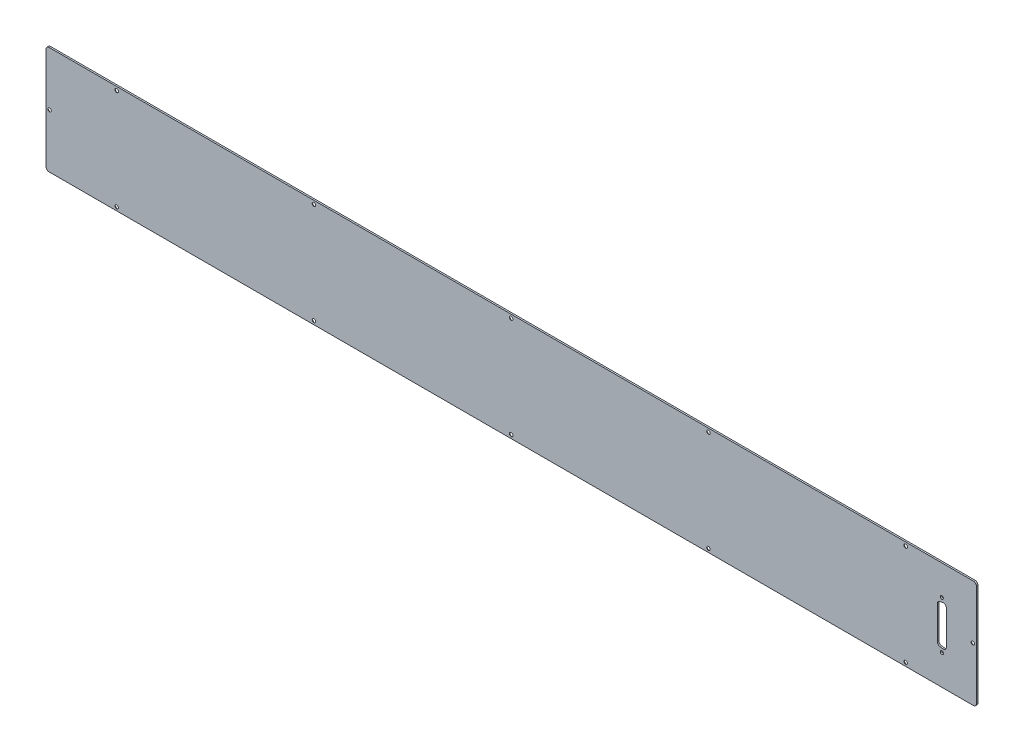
ISO-10303-21;
HEADER;
FILE_DESCRIPTION(('STEP AP214'),'2;1');
FILE_NAME('part.step','',(''),(''),'','','');
FILE_SCHEMA(('AUTOMOTIVE_DESIGN { 1 0 10303 214 1 1 1 1 }'));
ENDSEC;
DATA;
#1=APPLICATION_CONTEXT('core data for automotive mechanical design processes');
#2=APPLICATION_PROTOCOL_DEFINITION('international standard','automotive_design',2000,#1);
#3=PRODUCT_CONTEXT('',#1,'mechanical');
#4=PRODUCT('Part','Part','',(#3));
#5=PRODUCT_RELATED_PRODUCT_CATEGORY('part','',(#4));
#6=PRODUCT_DEFINITION_FORMATION('','',#4);
#7=PRODUCT_DEFINITION_CONTEXT('part definition',#1,'design');
#8=PRODUCT_DEFINITION('design','',#6,#7);
#9=PRODUCT_DEFINITION_SHAPE('','',#8);
#10=(LENGTH_UNIT() NAMED_UNIT(*) SI_UNIT(.MILLI.,.METRE.));
#11=(NAMED_UNIT(*) PLANE_ANGLE_UNIT() SI_UNIT($,.RADIAN.));
#12=(NAMED_UNIT(*) SI_UNIT($,.STERADIAN.) SOLID_ANGLE_UNIT());
#13=UNCERTAINTY_MEASURE_WITH_UNIT(LENGTH_MEASURE(1.E-05),#10,'distance_accuracy_value','');
#14=(GEOMETRIC_REPRESENTATION_CONTEXT(3) GLOBAL_UNCERTAINTY_ASSIGNED_CONTEXT((#13)) GLOBAL_UNIT_ASSIGNED_CONTEXT((#10,
#11,#12)) REPRESENTATION_CONTEXT('',''));
#15=CARTESIAN_POINT('',(0.,0.,0.));
#16=DIRECTION('',(0.,0.,1.));
#17=DIRECTION('',(1.,0.,0.));
#18=AXIS2_PLACEMENT_3D('',#15,#16,#17);
#19=CARTESIAN_POINT('',(457.5,-53.,1.5748));
#20=DIRECTION('',(-1.,0.,0.));
#21=DIRECTION('',(0.,0.,1.));
#22=AXIS2_PLACEMENT_3D('',#19,#20,#21);
#23=PLANE('',#22);
#24=DIRECTION('',(0.,1.,0.));
#25=VECTOR('',#24,1.);
#26=CARTESIAN_POINT('',(457.5,-53.,1.5748));
#27=LINE('',#26,#25);
#28=CARTESIAN_POINT('',(457.5,-50.,1.5748));
#29=VERTEX_POINT('',#28);
#30=CARTESIAN_POINT('',(457.5,50.,1.5748));
#31=VERTEX_POINT('',#30);
#32=EDGE_CURVE('E334',#29,#31,#27,.T.);
#33=ORIENTED_EDGE('',*,*,#32,.F.);
#34=DIRECTION('',(0.,0.,-1.));
#35=VECTOR('',#34,1.);
#36=CARTESIAN_POINT('',(457.5,-50.,1.5748));
#37=LINE('',#36,#35);
#38=CARTESIAN_POINT('',(457.5,-50.,0.));
#39=VERTEX_POINT('',#38);
#40=EDGE_CURVE('E11',#29,#39,#37,.T.);
#41=ORIENTED_EDGE('',*,*,#40,.T.);
#42=DIRECTION('',(0.,1.,0.));
#43=VECTOR('',#42,1.);
#44=CARTESIAN_POINT('',(457.5,-53.,0.));
#45=LINE('',#44,#43);
#46=CARTESIAN_POINT('',(457.5,50.,0.));
#47=VERTEX_POINT('',#46);
#48=EDGE_CURVE('E333',#39,#47,#45,.T.);
#49=ORIENTED_EDGE('',*,*,#48,.T.);
#50=DIRECTION('',(0.,0.,-1.));
#51=VECTOR('',#50,1.);
#52=CARTESIAN_POINT('',(457.5,50.,1.5748));
#53=LINE('',#52,#51);
#54=EDGE_CURVE('E42',#47,#31,#53,.F.);
#55=ORIENTED_EDGE('',*,*,#54,.T.);
#56=EDGE_LOOP('',(#33,#41,#49,#55));
#57=FACE_BOUND('',#56,.T.);
#58=ADVANCED_FACE('F34',(#57),#23,.F.);
#59=CARTESIAN_POINT('',(-457.5,53.,1.5748));
#60=DIRECTION('',(0.,-1.,0.));
#61=DIRECTION('',(0.,0.,-1.));
#62=AXIS2_PLACEMENT_3D('',#59,#60,#61);
#63=PLANE('',#62);
#64=DIRECTION('',(-1.,0.,0.));
#65=VECTOR('',#64,1.);
#66=CARTESIAN_POINT('',(-457.5,53.,0.));
#67=LINE('',#66,#65);
#68=CARTESIAN_POINT('',(454.5,53.,0.));
#69=VERTEX_POINT('',#68);
#70=CARTESIAN_POINT('',(-454.5,53.,0.));
#71=VERTEX_POINT('',#70);
#72=EDGE_CURVE('E350',#69,#71,#67,.T.);
#73=ORIENTED_EDGE('',*,*,#72,.T.);
#74=DIRECTION('',(0.,0.,-1.));
#75=VECTOR('',#74,1.);
#76=CARTESIAN_POINT('',(-454.5,53.,1.5748));
#77=LINE('',#76,#75);
#78=CARTESIAN_POINT('',(-454.5,53.,1.5748));
#79=VERTEX_POINT('',#78);
#80=EDGE_CURVE('E386',#71,#79,#77,.F.);
#81=ORIENTED_EDGE('',*,*,#80,.T.);
#82=DIRECTION('',(-1.,0.,0.));
#83=VECTOR('',#82,1.);
#84=CARTESIAN_POINT('',(-457.5,53.,1.5748));
#85=LINE('',#84,#83);
#86=CARTESIAN_POINT('',(454.5,53.,1.5748));
#87=VERTEX_POINT('',#86);
#88=EDGE_CURVE('E337',#87,#79,#85,.T.);
#89=ORIENTED_EDGE('',*,*,#88,.F.);
#90=DIRECTION('',(0.,0.,-1.));
#91=VECTOR('',#90,1.);
#92=CARTESIAN_POINT('',(454.5,53.,1.5748));
#93=LINE('',#92,#91);
#94=EDGE_CURVE('E383',#87,#69,#93,.T.);
#95=ORIENTED_EDGE('',*,*,#94,.T.);
#96=EDGE_LOOP('',(#73,#81,#89,#95));
#97=FACE_BOUND('',#96,.T.);
#98=ADVANCED_FACE('F400',(#97),#63,.F.);
#99=CARTESIAN_POINT('',(-457.5,-53.,1.5748));
#100=DIRECTION('',(1.,0.,0.));
#101=DIRECTION('',(0.,0.,-1.));
#102=AXIS2_PLACEMENT_3D('',#99,#100,#101);
#103=PLANE('',#102);
#104=DIRECTION('',(0.,-1.,0.));
#105=VECTOR('',#104,1.);
#106=CARTESIAN_POINT('',(-457.5,-53.,0.));
#107=LINE('',#106,#105);
#108=CARTESIAN_POINT('',(-457.5,50.,0.));
#109=VERTEX_POINT('',#108);
#110=CARTESIAN_POINT('',(-457.5,-50.,0.));
#111=VERTEX_POINT('',#110);
#112=EDGE_CURVE('E353',#109,#111,#107,.T.);
#113=ORIENTED_EDGE('',*,*,#112,.T.);
#114=DIRECTION('',(0.,0.,-1.));
#115=VECTOR('',#114,1.);
#116=CARTESIAN_POINT('',(-457.5,-50.,1.5748));
#117=LINE('',#116,#115);
#118=CARTESIAN_POINT('',(-457.5,-50.,1.5748));
#119=VERTEX_POINT('',#118);
#120=EDGE_CURVE('E373',#111,#119,#117,.F.);
#121=ORIENTED_EDGE('',*,*,#120,.T.);
#122=DIRECTION('',(0.,-1.,0.));
#123=VECTOR('',#122,1.);
#124=CARTESIAN_POINT('',(-457.5,-53.,1.5748));
#125=LINE('',#124,#123);
#126=CARTESIAN_POINT('',(-457.5,50.,1.5748));
#127=VERTEX_POINT('',#126);
#128=EDGE_CURVE('E341',#127,#119,#125,.T.);
#129=ORIENTED_EDGE('',*,*,#128,.F.);
#130=DIRECTION('',(0.,0.,-1.));
#131=VECTOR('',#130,1.);
#132=CARTESIAN_POINT('',(-457.5,50.,1.5748));
#133=LINE('',#132,#131);
#134=EDGE_CURVE('E370',#127,#109,#133,.T.);
#135=ORIENTED_EDGE('',*,*,#134,.T.);
#136=EDGE_LOOP('',(#113,#121,#129,#135));
#137=FACE_BOUND('',#136,.T.);
#138=ADVANCED_FACE('F412',(#137),#103,.F.);
#139=CARTESIAN_POINT('',(-457.5,-53.,1.5748));
#140=DIRECTION('',(0.,1.,0.));
#141=DIRECTION('',(0.,0.,1.));
#142=AXIS2_PLACEMENT_3D('',#139,#140,#141);
#143=PLANE('',#142);
#144=DIRECTION('',(1.,0.,0.));
#145=VECTOR('',#144,1.);
#146=CARTESIAN_POINT('',(-457.5,-53.,1.5748));
#147=LINE('',#146,#145);
#148=CARTESIAN_POINT('',(-454.5,-53.,1.5748));
#149=VERTEX_POINT('',#148);
#150=CARTESIAN_POINT('',(454.5,-53.,1.5748));
#151=VERTEX_POINT('',#150);
#152=EDGE_CURVE('E344',#149,#151,#147,.T.);
#153=ORIENTED_EDGE('',*,*,#152,.F.);
#154=DIRECTION('',(0.,0.,-1.));
#155=VECTOR('',#154,1.);
#156=CARTESIAN_POINT('',(-454.5,-53.,1.5748));
#157=LINE('',#156,#155);
#158=CARTESIAN_POINT('',(-454.5,-53.,0.));
#159=VERTEX_POINT('',#158);
#160=EDGE_CURVE('E359',#149,#159,#157,.T.);
#161=ORIENTED_EDGE('',*,*,#160,.T.);
#162=DIRECTION('',(1.,0.,0.));
#163=VECTOR('',#162,1.);
#164=CARTESIAN_POINT('',(-457.5,-53.,0.));
#165=LINE('',#164,#163);
#166=CARTESIAN_POINT('',(454.5,-53.,0.));
#167=VERTEX_POINT('',#166);
#168=EDGE_CURVE('E338',#159,#167,#165,.T.);
#169=ORIENTED_EDGE('',*,*,#168,.T.);
#170=DIRECTION('',(0.,0.,-1.));
#171=VECTOR('',#170,1.);
#172=CARTESIAN_POINT('',(454.5,-53.,1.5748));
#173=LINE('',#172,#171);
#174=EDGE_CURVE('E347',#167,#151,#173,.F.);
#175=ORIENTED_EDGE('',*,*,#174,.T.);
#176=EDGE_LOOP('',(#153,#161,#169,#175));
#177=FACE_BOUND('',#176,.T.);
#178=ADVANCED_FACE('F420',(#177),#143,.F.);
#179=CARTESIAN_POINT('',(0.,0.,1.5748));
#180=DIRECTION('',(0.,0.,-1.));
#181=DIRECTION('',(-1.,0.,0.));
#182=AXIS2_PLACEMENT_3D('',#179,#180,#181);
#183=PLANE('',#182);
#184=CARTESIAN_POINT('',(423.5,-23.5,1.5748));
#185=DIRECTION('',(0.,0.,-1.));
#186=DIRECTION('',(1.,0.,0.));
#187=AXIS2_PLACEMENT_3D('',#184,#185,#186);
#188=CIRCLE('',#187,1.54999999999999);
#189=CARTESIAN_POINT('',(425.05,-23.5,1.5748));
#190=VERTEX_POINT('',#189);
#191=EDGE_CURVE('E190',#190,#190,#188,.T.);
#192=ORIENTED_EDGE('',*,*,#191,.T.);
#193=EDGE_LOOP('',(#192));
#194=FACE_BOUND('',#193,.T.);
#195=DIRECTION('',(0.,1.,0.));
#196=VECTOR('',#195,1.);
#197=CARTESIAN_POINT('',(419.05,16.22665,1.5748));
#198=LINE('',#197,#196);
#199=CARTESIAN_POINT('',(419.05,-16.22665,1.5748));
#200=VERTEX_POINT('',#199);
#201=CARTESIAN_POINT('',(419.05,16.22665,1.5748));
#202=VERTEX_POINT('',#201);
#203=EDGE_CURVE('E155',#200,#202,#198,.T.);
#204=ORIENTED_EDGE('',*,*,#203,.T.);
#205=CARTESIAN_POINT('',(422.05,16.22665,1.5748));
#206=DIRECTION('',(0.,0.,-1.));
#207=DIRECTION('',(1.,0.,0.));
#208=AXIS2_PLACEMENT_3D('',#205,#206,#207);
#209=CIRCLE('',#208,3.00000000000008);
#210=CARTESIAN_POINT('',(421.529053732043,19.1810729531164,1.5748));
#211=VERTEX_POINT('',#210);
#212=EDGE_CURVE('E149',#202,#211,#209,.T.);
#213=ORIENTED_EDGE('',*,*,#212,.T.);
#214=DIRECTION('',(0.984807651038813,0.173648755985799,0.));
#215=VECTOR('',#214,1.);
#216=CARTESIAN_POINT('',(424.429053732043,19.6924229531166,1.5748));
#217=LINE('',#216,#215);
#218=CARTESIAN_POINT('',(424.429053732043,19.6924229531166,1.5748));
#219=VERTEX_POINT('',#218);
#220=EDGE_CURVE('E158',#211,#219,#217,.T.);
#221=ORIENTED_EDGE('',*,*,#220,.T.);
#222=CARTESIAN_POINT('',(424.95,16.7380000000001,1.5748));
#223=DIRECTION('',(0.,0.,-1.));
#224=DIRECTION('',(1.,0.,0.));
#225=AXIS2_PLACEMENT_3D('',#222,#223,#224);
#226=CIRCLE('',#225,2.99999999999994);
#227=CARTESIAN_POINT('',(427.95,16.7380000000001,1.5748));
#228=VERTEX_POINT('',#227);
#229=EDGE_CURVE('E49',#219,#228,#226,.T.);
#230=ORIENTED_EDGE('',*,*,#229,.T.);
#231=DIRECTION('',(0.,-1.,0.));
#232=VECTOR('',#231,1.);
#233=CARTESIAN_POINT('',(427.95,-16.7380000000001,1.5748));
#234=LINE('',#233,#232);
#235=CARTESIAN_POINT('',(427.95,-16.7380000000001,1.5748));
#236=VERTEX_POINT('',#235);
#237=EDGE_CURVE('E176',#228,#236,#234,.T.);
#238=ORIENTED_EDGE('',*,*,#237,.T.);
#239=CARTESIAN_POINT('',(424.95,-16.7380000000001,1.5748));
#240=DIRECTION('',(0.,0.,-1.));
#241=DIRECTION('',(-1.,0.,0.));
#242=AXIS2_PLACEMENT_3D('',#239,#240,#241);
#243=CIRCLE('',#242,2.99999999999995);
#244=CARTESIAN_POINT('',(424.429053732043,-19.6924229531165,1.5748));
#245=VERTEX_POINT('',#244);
#246=EDGE_CURVE('E179',#236,#245,#243,.T.);
#247=ORIENTED_EDGE('',*,*,#246,.T.);
#248=DIRECTION('',(-0.984807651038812,0.173648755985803,0.));
#249=VECTOR('',#248,1.);
#250=CARTESIAN_POINT('',(424.429053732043,-19.6924229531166,1.5748));
#251=LINE('',#250,#249);
#252=CARTESIAN_POINT('',(421.529053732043,-19.1810729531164,1.5748));
#253=VERTEX_POINT('',#252);
#254=EDGE_CURVE('E182',#245,#253,#251,.T.);
#255=ORIENTED_EDGE('',*,*,#254,.T.);
#256=CARTESIAN_POINT('',(422.05,-16.22665,1.5748));
#257=DIRECTION('',(0.,0.,-1.));
#258=DIRECTION('',(-1.,0.,0.));
#259=AXIS2_PLACEMENT_3D('',#256,#257,#258);
#260=CIRCLE('',#259,3.00000000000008);
#261=EDGE_CURVE('E185',#253,#200,#260,.T.);
#262=ORIENTED_EDGE('',*,*,#261,.T.);
#263=EDGE_LOOP('',(#204,#213,#221,#230,#238,#247,#255,#262));
#264=FACE_BOUND('',#263,.T.);
#265=CARTESIAN_POINT('',(423.5,23.5,1.5748));
#266=DIRECTION('',(0.,0.,-1.));
#267=DIRECTION('',(-1.,0.,0.));
#268=AXIS2_PLACEMENT_3D('',#265,#266,#267);
#269=CIRCLE('',#268,1.54999999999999);
#270=CARTESIAN_POINT('',(421.95,23.5,1.5748));
#271=VERTEX_POINT('',#270);
#272=EDGE_CURVE('E220',#271,#271,#269,.T.);
#273=ORIENTED_EDGE('',*,*,#272,.T.);
#274=EDGE_LOOP('',(#273));
#275=FACE_BOUND('',#274,.T.);
#276=CARTESIAN_POINT('',(-388.,49.5,1.5748));
#277=DIRECTION('',(0.,0.,-1.));
#278=DIRECTION('',(-1.,0.,0.));
#279=AXIS2_PLACEMENT_3D('',#276,#277,#278);
#280=CIRCLE('',#279,1.69999999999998);
#281=CARTESIAN_POINT('',(-389.7,49.5,1.5748));
#282=VERTEX_POINT('',#281);
#283=EDGE_CURVE('E231',#282,#282,#280,.T.);
#284=ORIENTED_EDGE('',*,*,#283,.T.);
#285=EDGE_LOOP('',(#284));
#286=FACE_BOUND('',#285,.T.);
#287=CARTESIAN_POINT('',(-194.,49.5,1.5748));
#288=DIRECTION('',(0.,0.,-1.));
#289=DIRECTION('',(-1.,0.,0.));
#290=AXIS2_PLACEMENT_3D('',#287,#288,#289);
#291=CIRCLE('',#290,1.70000000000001);
#292=CARTESIAN_POINT('',(-195.7,49.5,1.5748));
#293=VERTEX_POINT('',#292);
#294=EDGE_CURVE('E240',#293,#293,#291,.T.);
#295=ORIENTED_EDGE('',*,*,#294,.T.);
#296=EDGE_LOOP('',(#295));
#297=FACE_BOUND('',#296,.T.);
#298=CARTESIAN_POINT('',(0.,49.5,1.5748));
#299=DIRECTION('',(0.,0.,-1.));
#300=DIRECTION('',(-1.,0.,0.));
#301=AXIS2_PLACEMENT_3D('',#298,#299,#300);
#302=CIRCLE('',#301,1.7);
#303=CARTESIAN_POINT('',(-1.7,49.5,1.5748));
#304=VERTEX_POINT('',#303);
#305=EDGE_CURVE('E249',#304,#304,#302,.T.);
#306=ORIENTED_EDGE('',*,*,#305,.T.);
#307=EDGE_LOOP('',(#306));
#308=FACE_BOUND('',#307,.T.);
#309=CARTESIAN_POINT('',(-194.,-49.5000000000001,1.5748));
#310=DIRECTION('',(0.,0.,-1.));
#311=DIRECTION('',(-1.,0.,0.));
#312=AXIS2_PLACEMENT_3D('',#309,#310,#311);
#313=CIRCLE('',#312,1.70000000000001);
#314=CARTESIAN_POINT('',(-195.7,-49.5000000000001,1.5748));
#315=VERTEX_POINT('',#314);
#316=EDGE_CURVE('E258',#315,#315,#313,.T.);
#317=ORIENTED_EDGE('',*,*,#316,.T.);
#318=EDGE_LOOP('',(#317));
#319=FACE_BOUND('',#318,.T.);
#320=CARTESIAN_POINT('',(-388.,-49.5000000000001,1.5748));
#321=DIRECTION('',(0.,0.,-1.));
#322=DIRECTION('',(-1.,0.,0.));
#323=AXIS2_PLACEMENT_3D('',#320,#321,#322);
#324=CIRCLE('',#323,1.69999999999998);
#325=CARTESIAN_POINT('',(-389.7,-49.5000000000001,1.5748));
#326=VERTEX_POINT('',#325);
#327=EDGE_CURVE('E267',#326,#326,#324,.T.);
#328=ORIENTED_EDGE('',*,*,#327,.T.);
#329=EDGE_LOOP('',(#328));
#330=FACE_BOUND('',#329,.T.);
#331=CARTESIAN_POINT('',(0.,-49.5,1.5748));
#332=DIRECTION('',(0.,0.,-1.));
#333=DIRECTION('',(-1.,0.,0.));
#334=AXIS2_PLACEMENT_3D('',#331,#332,#333);
#335=CIRCLE('',#334,1.7);
#336=CARTESIAN_POINT('',(-1.7,-49.5,1.5748));
#337=VERTEX_POINT('',#336);
#338=EDGE_CURVE('E276',#337,#337,#335,.T.);
#339=ORIENTED_EDGE('',*,*,#338,.T.);
#340=EDGE_LOOP('',(#339));
#341=FACE_BOUND('',#340,.T.);
#342=CARTESIAN_POINT('',(388.,-49.5000000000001,1.5748));
#343=DIRECTION('',(0.,0.,-1.));
#344=DIRECTION('',(-1.,0.,0.));
#345=AXIS2_PLACEMENT_3D('',#342,#343,#344);
#346=CIRCLE('',#345,1.69999999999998);
#347=CARTESIAN_POINT('',(386.3,-49.5000000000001,1.5748));
#348=VERTEX_POINT('',#347);
#349=EDGE_CURVE('E285',#348,#348,#346,.T.);
#350=ORIENTED_EDGE('',*,*,#349,.T.);
#351=EDGE_LOOP('',(#350));
#352=FACE_BOUND('',#351,.T.);
#353=CARTESIAN_POINT('',(388.,49.5000000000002,1.5748));
#354=DIRECTION('',(0.,0.,-1.));
#355=DIRECTION('',(-1.,0.,0.));
#356=AXIS2_PLACEMENT_3D('',#353,#354,#355);
#357=CIRCLE('',#356,1.69999999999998);
#358=CARTESIAN_POINT('',(386.3,49.5000000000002,1.5748));
#359=VERTEX_POINT('',#358);
#360=EDGE_CURVE('E294',#359,#359,#357,.T.);
#361=ORIENTED_EDGE('',*,*,#360,.T.);
#362=EDGE_LOOP('',(#361));
#363=FACE_BOUND('',#362,.T.);
#364=CARTESIAN_POINT('',(194.,49.5000000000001,1.5748));
#365=DIRECTION('',(0.,0.,-1.));
#366=DIRECTION('',(-1.,0.,0.));
#367=AXIS2_PLACEMENT_3D('',#364,#365,#366);
#368=CIRCLE('',#367,1.70000000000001);
#369=CARTESIAN_POINT('',(192.3,49.5000000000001,1.5748));
#370=VERTEX_POINT('',#369);
#371=EDGE_CURVE('E303',#370,#370,#368,.T.);
#372=ORIENTED_EDGE('',*,*,#371,.T.);
#373=EDGE_LOOP('',(#372));
#374=FACE_BOUND('',#373,.T.);
#375=CARTESIAN_POINT('',(194.,-49.5000000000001,1.5748));
#376=DIRECTION('',(0.,0.,-1.));
#377=DIRECTION('',(-1.,0.,0.));
#378=AXIS2_PLACEMENT_3D('',#375,#376,#377);
#379=CIRCLE('',#378,1.70000000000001);
#380=CARTESIAN_POINT('',(192.3,-49.5000000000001,1.5748));
#381=VERTEX_POINT('',#380);
#382=EDGE_CURVE('E312',#381,#381,#379,.T.);
#383=ORIENTED_EDGE('',*,*,#382,.T.);
#384=EDGE_LOOP('',(#383));
#385=FACE_BOUND('',#384,.T.);
#386=CARTESIAN_POINT('',(-454.,0.,1.5748));
#387=DIRECTION('',(0.,0.,-1.));
#388=DIRECTION('',(-1.,0.,0.));
#389=AXIS2_PLACEMENT_3D('',#386,#387,#388);
#390=CIRCLE('',#389,1.69999999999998);
#391=CARTESIAN_POINT('',(-455.7,0.,1.5748));
#392=VERTEX_POINT('',#391);
#393=EDGE_CURVE('E321',#392,#392,#390,.T.);
#394=ORIENTED_EDGE('',*,*,#393,.T.);
#395=EDGE_LOOP('',(#394));
#396=FACE_BOUND('',#395,.T.);
#397=CARTESIAN_POINT('',(454.,0.,1.5748));
#398=DIRECTION('',(0.,0.,-1.));
#399=DIRECTION('',(-1.,0.,0.));
#400=AXIS2_PLACEMENT_3D('',#397,#398,#399);
#401=CIRCLE('',#400,1.69999999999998);
#402=CARTESIAN_POINT('',(452.3,0.,1.5748));
#403=VERTEX_POINT('',#402);
#404=EDGE_CURVE('E330',#403,#403,#401,.T.);
#405=ORIENTED_EDGE('',*,*,#404,.T.);
#406=EDGE_LOOP('',(#405));
#407=FACE_BOUND('',#406,.T.);
#408=ORIENTED_EDGE('',*,*,#128,.T.);
#409=CARTESIAN_POINT('',(-454.5,-50.,1.5748));
#410=DIRECTION('',(0.,0.,-1.));
#411=DIRECTION('',(-1.,0.,0.));
#412=AXIS2_PLACEMENT_3D('',#409,#410,#411);
#413=CIRCLE('',#412,3.);
#414=EDGE_CURVE('E381',#119,#149,#413,.F.);
#415=ORIENTED_EDGE('',*,*,#414,.T.);
#416=ORIENTED_EDGE('',*,*,#152,.T.);
#417=CARTESIAN_POINT('',(454.5,-50.,1.5748));
#418=DIRECTION('',(0.,0.,-1.));
#419=DIRECTION('',(-1.,0.,0.));
#420=AXIS2_PLACEMENT_3D('',#417,#418,#419);
#421=CIRCLE('',#420,3.);
#422=EDGE_CURVE('E377',#151,#29,#421,.F.);
#423=ORIENTED_EDGE('',*,*,#422,.T.);
#424=ORIENTED_EDGE('',*,*,#32,.T.);
#425=CARTESIAN_POINT('',(454.5,50.,1.5748));
#426=DIRECTION('',(0.,0.,-1.));
#427=DIRECTION('',(-1.,0.,0.));
#428=AXIS2_PLACEMENT_3D('',#425,#426,#427);
#429=CIRCLE('',#428,3.);
#430=EDGE_CURVE('E375',#31,#87,#429,.F.);
#431=ORIENTED_EDGE('',*,*,#430,.T.);
#432=ORIENTED_EDGE('',*,*,#88,.T.);
#433=CARTESIAN_POINT('',(-454.5,50.,1.5748));
#434=DIRECTION('',(0.,0.,-1.));
#435=DIRECTION('',(-1.,0.,0.));
#436=AXIS2_PLACEMENT_3D('',#433,#434,#435);
#437=CIRCLE('',#436,3.);
#438=EDGE_CURVE('E379',#79,#127,#437,.F.);
#439=ORIENTED_EDGE('',*,*,#438,.T.);
#440=EDGE_LOOP('',(#408,#415,#416,#423,#424,#431,#432,#439));
#441=FACE_BOUND('',#440,.T.);
#442=ADVANCED_FACE('F162',(#194,#264,#275,#286,#297,#308,#319,#330,#341,#352,#363,#374,#385,
#396,#407,#441),#183,.F.);
#443=CARTESIAN_POINT('',(0.,0.,0.));
#444=DIRECTION('',(0.,0.,-1.));
#445=DIRECTION('',(-1.,0.,0.));
#446=AXIS2_PLACEMENT_3D('',#443,#444,#445);
#447=PLANE('',#446);
#448=CARTESIAN_POINT('',(423.5,-23.5,0.));
#449=DIRECTION('',(0.,0.,-1.));
#450=DIRECTION('',(1.,0.,0.));
#451=AXIS2_PLACEMENT_3D('',#448,#449,#450);
#452=CIRCLE('',#451,1.54999999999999);
#453=CARTESIAN_POINT('',(425.05,-23.5,0.));
#454=VERTEX_POINT('',#453);
#455=EDGE_CURVE('E172',#454,#454,#452,.T.);
#456=ORIENTED_EDGE('',*,*,#455,.F.);
#457=EDGE_LOOP('',(#456));
#458=FACE_BOUND('',#457,.T.);
#459=CARTESIAN_POINT('',(422.05,16.22665,0.));
#460=DIRECTION('',(0.,0.,-1.));
#461=DIRECTION('',(1.,0.,0.));
#462=AXIS2_PLACEMENT_3D('',#459,#460,#461);
#463=CIRCLE('',#462,3.00000000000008);
#464=CARTESIAN_POINT('',(419.05,16.22665,0.));
#465=VERTEX_POINT('',#464);
#466=CARTESIAN_POINT('',(421.529053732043,19.1810729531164,0.));
#467=VERTEX_POINT('',#466);
#468=EDGE_CURVE('E57',#465,#467,#463,.T.);
#469=ORIENTED_EDGE('',*,*,#468,.F.);
#470=DIRECTION('',(0.,1.,0.));
#471=VECTOR('',#470,1.);
#472=CARTESIAN_POINT('',(419.05,16.22665,0.));
#473=LINE('',#472,#471);
#474=CARTESIAN_POINT('',(419.05,-16.22665,0.));
#475=VERTEX_POINT('',#474);
#476=EDGE_CURVE('E166',#475,#465,#473,.T.);
#477=ORIENTED_EDGE('',*,*,#476,.F.);
#478=CARTESIAN_POINT('',(422.05,-16.22665,0.));
#479=DIRECTION('',(0.,0.,-1.));
#480=DIRECTION('',(-1.,0.,0.));
#481=AXIS2_PLACEMENT_3D('',#478,#479,#480);
#482=CIRCLE('',#481,3.00000000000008);
#483=CARTESIAN_POINT('',(421.529053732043,-19.1810729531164,0.));
#484=VERTEX_POINT('',#483);
#485=EDGE_CURVE('E169',#484,#475,#482,.T.);
#486=ORIENTED_EDGE('',*,*,#485,.F.);
#487=DIRECTION('',(-0.984807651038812,0.173648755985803,0.));
#488=VECTOR('',#487,1.);
#489=CARTESIAN_POINT('',(424.429053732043,-19.6924229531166,0.));
#490=LINE('',#489,#488);
#491=CARTESIAN_POINT('',(424.429053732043,-19.6924229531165,0.));
#492=VERTEX_POINT('',#491);
#493=EDGE_CURVE('E201',#492,#484,#490,.T.);
#494=ORIENTED_EDGE('',*,*,#493,.F.);
#495=CARTESIAN_POINT('',(424.95,-16.7380000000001,0.));
#496=DIRECTION('',(0.,0.,-1.));
#497=DIRECTION('',(-1.,0.,0.));
#498=AXIS2_PLACEMENT_3D('',#495,#496,#497);
#499=CIRCLE('',#498,2.99999999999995);
#500=CARTESIAN_POINT('',(427.95,-16.7380000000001,0.));
#501=VERTEX_POINT('',#500);
#502=EDGE_CURVE('E198',#501,#492,#499,.T.);
#503=ORIENTED_EDGE('',*,*,#502,.F.);
#504=DIRECTION('',(0.,-1.,0.));
#505=VECTOR('',#504,1.);
#506=CARTESIAN_POINT('',(427.95,-16.7380000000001,0.));
#507=LINE('',#506,#505);
#508=CARTESIAN_POINT('',(427.95,16.7380000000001,0.));
#509=VERTEX_POINT('',#508);
#510=EDGE_CURVE('E195',#509,#501,#507,.T.);
#511=ORIENTED_EDGE('',*,*,#510,.F.);
#512=CARTESIAN_POINT('',(424.95,16.7380000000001,0.));
#513=DIRECTION('',(0.,0.,-1.));
#514=DIRECTION('',(1.,0.,0.));
#515=AXIS2_PLACEMENT_3D('',#512,#513,#514);
#516=CIRCLE('',#515,2.99999999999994);
#517=CARTESIAN_POINT('',(424.429053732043,19.6924229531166,0.));
#518=VERTEX_POINT('',#517);
#519=EDGE_CURVE('E192',#518,#509,#516,.T.);
#520=ORIENTED_EDGE('',*,*,#519,.F.);
#521=DIRECTION('',(0.984807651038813,0.173648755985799,0.));
#522=VECTOR('',#521,1.);
#523=CARTESIAN_POINT('',(424.429053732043,19.6924229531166,0.));
#524=LINE('',#523,#522);
#525=EDGE_CURVE('E189',#467,#518,#524,.T.);
#526=ORIENTED_EDGE('',*,*,#525,.F.);
#527=EDGE_LOOP('',(#469,#477,#486,#494,#503,#511,#520,#526));
#528=FACE_BOUND('',#527,.T.);
#529=CARTESIAN_POINT('',(423.5,23.5,0.));
#530=DIRECTION('',(0.,0.,-1.));
#531=DIRECTION('',(-1.,0.,0.));
#532=AXIS2_PLACEMENT_3D('',#529,#530,#531);
#533=CIRCLE('',#532,1.54999999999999);
#534=CARTESIAN_POINT('',(421.95,23.5,0.));
#535=VERTEX_POINT('',#534);
#536=EDGE_CURVE('E208',#535,#535,#533,.T.);
#537=ORIENTED_EDGE('',*,*,#536,.F.);
#538=EDGE_LOOP('',(#537));
#539=FACE_BOUND('',#538,.T.);
#540=CARTESIAN_POINT('',(-388.,49.5,0.));
#541=DIRECTION('',(0.,0.,-1.));
#542=DIRECTION('',(-1.,0.,0.));
#543=AXIS2_PLACEMENT_3D('',#540,#541,#542);
#544=CIRCLE('',#543,3.14999999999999);
#545=CARTESIAN_POINT('',(-391.15,49.5,0.));
#546=VERTEX_POINT('',#545);
#547=EDGE_CURVE('E223',#546,#546,#544,.T.);
#548=ORIENTED_EDGE('',*,*,#547,.F.);
#549=EDGE_LOOP('',(#548));
#550=FACE_BOUND('',#549,.T.);
#551=CARTESIAN_POINT('',(-194.,49.5,0.));
#552=DIRECTION('',(0.,0.,-1.));
#553=DIRECTION('',(-1.,0.,0.));
#554=AXIS2_PLACEMENT_3D('',#551,#552,#553);
#555=CIRCLE('',#554,3.14999999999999);
#556=CARTESIAN_POINT('',(-197.15,49.5,0.));
#557=VERTEX_POINT('',#556);
#558=EDGE_CURVE('E234',#557,#557,#555,.T.);
#559=ORIENTED_EDGE('',*,*,#558,.F.);
#560=EDGE_LOOP('',(#559));
#561=FACE_BOUND('',#560,.T.);
#562=CARTESIAN_POINT('',(0.,49.5,0.));
#563=DIRECTION('',(0.,0.,-1.));
#564=DIRECTION('',(-1.,0.,0.));
#565=AXIS2_PLACEMENT_3D('',#562,#563,#564);
#566=CIRCLE('',#565,3.15);
#567=CARTESIAN_POINT('',(-3.15,49.5,0.));
#568=VERTEX_POINT('',#567);
#569=EDGE_CURVE('E243',#568,#568,#566,.T.);
#570=ORIENTED_EDGE('',*,*,#569,.F.);
#571=EDGE_LOOP('',(#570));
#572=FACE_BOUND('',#571,.T.);
#573=CARTESIAN_POINT('',(-194.,-49.5000000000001,0.));
#574=DIRECTION('',(0.,0.,-1.));
#575=DIRECTION('',(-1.,0.,0.));
#576=AXIS2_PLACEMENT_3D('',#573,#574,#575);
#577=CIRCLE('',#576,3.14999999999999);
#578=CARTESIAN_POINT('',(-197.15,-49.5000000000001,0.));
#579=VERTEX_POINT('',#578);
#580=EDGE_CURVE('E252',#579,#579,#577,.T.);
#581=ORIENTED_EDGE('',*,*,#580,.F.);
#582=EDGE_LOOP('',(#581));
#583=FACE_BOUND('',#582,.T.);
#584=CARTESIAN_POINT('',(-388.,-49.5000000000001,0.));
#585=DIRECTION('',(0.,0.,-1.));
#586=DIRECTION('',(-1.,0.,0.));
#587=AXIS2_PLACEMENT_3D('',#584,#585,#586);
#588=CIRCLE('',#587,3.14999999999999);
#589=CARTESIAN_POINT('',(-391.15,-49.5000000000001,0.));
#590=VERTEX_POINT('',#589);
#591=EDGE_CURVE('E261',#590,#590,#588,.T.);
#592=ORIENTED_EDGE('',*,*,#591,.F.);
#593=EDGE_LOOP('',(#592));
#594=FACE_BOUND('',#593,.T.);
#595=CARTESIAN_POINT('',(0.,-49.5,0.));
#596=DIRECTION('',(0.,0.,-1.));
#597=DIRECTION('',(-1.,0.,0.));
#598=AXIS2_PLACEMENT_3D('',#595,#596,#597);
#599=CIRCLE('',#598,3.15);
#600=CARTESIAN_POINT('',(-3.15,-49.5,0.));
#601=VERTEX_POINT('',#600);
#602=EDGE_CURVE('E270',#601,#601,#599,.T.);
#603=ORIENTED_EDGE('',*,*,#602,.F.);
#604=EDGE_LOOP('',(#603));
#605=FACE_BOUND('',#604,.T.);
#606=CARTESIAN_POINT('',(388.,-49.5000000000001,0.));
#607=DIRECTION('',(0.,0.,-1.));
#608=DIRECTION('',(-1.,0.,0.));
#609=AXIS2_PLACEMENT_3D('',#606,#607,#608);
#610=CIRCLE('',#609,3.14999999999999);
#611=CARTESIAN_POINT('',(384.85,-49.5000000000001,0.));
#612=VERTEX_POINT('',#611);
#613=EDGE_CURVE('E279',#612,#612,#610,.T.);
#614=ORIENTED_EDGE('',*,*,#613,.F.);
#615=EDGE_LOOP('',(#614));
#616=FACE_BOUND('',#615,.T.);
#617=CARTESIAN_POINT('',(388.,49.5000000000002,0.));
#618=DIRECTION('',(0.,0.,-1.));
#619=DIRECTION('',(-1.,0.,0.));
#620=AXIS2_PLACEMENT_3D('',#617,#618,#619);
#621=CIRCLE('',#620,3.14999999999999);
#622=CARTESIAN_POINT('',(384.85,49.5000000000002,0.));
#623=VERTEX_POINT('',#622);
#624=EDGE_CURVE('E288',#623,#623,#621,.T.);
#625=ORIENTED_EDGE('',*,*,#624,.F.);
#626=EDGE_LOOP('',(#625));
#627=FACE_BOUND('',#626,.T.);
#628=CARTESIAN_POINT('',(194.,49.5000000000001,0.));
#629=DIRECTION('',(0.,0.,-1.));
#630=DIRECTION('',(-1.,0.,0.));
#631=AXIS2_PLACEMENT_3D('',#628,#629,#630);
#632=CIRCLE('',#631,3.14999999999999);
#633=CARTESIAN_POINT('',(190.85,49.5000000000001,0.));
#634=VERTEX_POINT('',#633);
#635=EDGE_CURVE('E297',#634,#634,#632,.T.);
#636=ORIENTED_EDGE('',*,*,#635,.F.);
#637=EDGE_LOOP('',(#636));
#638=FACE_BOUND('',#637,.T.);
#639=CARTESIAN_POINT('',(194.,-49.5000000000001,0.));
#640=DIRECTION('',(0.,0.,-1.));
#641=DIRECTION('',(-1.,0.,0.));
#642=AXIS2_PLACEMENT_3D('',#639,#640,#641);
#643=CIRCLE('',#642,3.14999999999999);
#644=CARTESIAN_POINT('',(190.85,-49.5000000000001,0.));
#645=VERTEX_POINT('',#644);
#646=EDGE_CURVE('E306',#645,#645,#643,.T.);
#647=ORIENTED_EDGE('',*,*,#646,.F.);
#648=EDGE_LOOP('',(#647));
#649=FACE_BOUND('',#648,.T.);
#650=CARTESIAN_POINT('',(-454.,0.,0.));
#651=DIRECTION('',(0.,0.,-1.));
#652=DIRECTION('',(-1.,0.,0.));
#653=AXIS2_PLACEMENT_3D('',#650,#651,#652);
#654=CIRCLE('',#653,3.14999999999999);
#655=CARTESIAN_POINT('',(-457.15,0.,0.));
#656=VERTEX_POINT('',#655);
#657=EDGE_CURVE('E315',#656,#656,#654,.T.);
#658=ORIENTED_EDGE('',*,*,#657,.F.);
#659=EDGE_LOOP('',(#658));
#660=FACE_BOUND('',#659,.T.);
#661=CARTESIAN_POINT('',(454.,0.,0.));
#662=DIRECTION('',(0.,0.,-1.));
#663=DIRECTION('',(-1.,0.,0.));
#664=AXIS2_PLACEMENT_3D('',#661,#662,#663);
#665=CIRCLE('',#664,3.14999999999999);
#666=CARTESIAN_POINT('',(450.85,0.,0.));
#667=VERTEX_POINT('',#666);
#668=EDGE_CURVE('E324',#667,#667,#665,.T.);
#669=ORIENTED_EDGE('',*,*,#668,.F.);
#670=EDGE_LOOP('',(#669));
#671=FACE_BOUND('',#670,.T.);
#672=ORIENTED_EDGE('',*,*,#168,.F.);
#673=CARTESIAN_POINT('',(-454.5,-50.,0.));
#674=DIRECTION('',(0.,0.,-1.));
#675=DIRECTION('',(-1.,0.,0.));
#676=AXIS2_PLACEMENT_3D('',#673,#674,#675);
#677=CIRCLE('',#676,3.);
#678=EDGE_CURVE('E368',#159,#111,#677,.T.);
#679=ORIENTED_EDGE('',*,*,#678,.T.);
#680=ORIENTED_EDGE('',*,*,#112,.F.);
#681=CARTESIAN_POINT('',(-454.5,50.,0.));
#682=DIRECTION('',(0.,0.,-1.));
#683=DIRECTION('',(-1.,0.,0.));
#684=AXIS2_PLACEMENT_3D('',#681,#682,#683);
#685=CIRCLE('',#684,3.);
#686=EDGE_CURVE('E366',#109,#71,#685,.T.);
#687=ORIENTED_EDGE('',*,*,#686,.T.);
#688=ORIENTED_EDGE('',*,*,#72,.F.);
#689=CARTESIAN_POINT('',(454.5,50.,0.));
#690=DIRECTION('',(0.,0.,-1.));
#691=DIRECTION('',(-1.,0.,0.));
#692=AXIS2_PLACEMENT_3D('',#689,#690,#691);
#693=CIRCLE('',#692,3.);
#694=EDGE_CURVE('E362',#69,#47,#693,.T.);
#695=ORIENTED_EDGE('',*,*,#694,.T.);
#696=ORIENTED_EDGE('',*,*,#48,.F.);
#697=CARTESIAN_POINT('',(454.5,-50.,0.));
#698=DIRECTION('',(0.,0.,-1.));
#699=DIRECTION('',(-1.,0.,0.));
#700=AXIS2_PLACEMENT_3D('',#697,#698,#699);
#701=CIRCLE('',#700,3.);
#702=EDGE_CURVE('E364',#39,#167,#701,.T.);
#703=ORIENTED_EDGE('',*,*,#702,.T.);
#704=EDGE_LOOP('',(#672,#679,#680,#687,#688,#695,#696,#703));
#705=FACE_BOUND('',#704,.T.);
#706=ADVANCED_FACE('F404',(#458,#528,#539,#550,#561,#572,#583,#594,#605,#616,#627,#638,#649,
#660,#671,#705),#447,.T.);
#707=CARTESIAN_POINT('',(-454.5,-50.,1.5748));
#708=DIRECTION('',(0.,0.,-1.));
#709=DIRECTION('',(-1.,0.,0.));
#710=AXIS2_PLACEMENT_3D('',#707,#708,#709);
#711=CYLINDRICAL_SURFACE('',#710,3.);
#712=ORIENTED_EDGE('',*,*,#414,.F.);
#713=ORIENTED_EDGE('',*,*,#120,.F.);
#714=ORIENTED_EDGE('',*,*,#678,.F.);
#715=ORIENTED_EDGE('',*,*,#160,.F.);
#716=EDGE_LOOP('',(#712,#713,#714,#715));
#717=FACE_BOUND('',#716,.T.);
#718=ADVANCED_FACE('F418',(#717),#711,.T.);
#719=CARTESIAN_POINT('',(-454.5,50.,1.5748));
#720=DIRECTION('',(0.,0.,-1.));
#721=DIRECTION('',(-1.,0.,0.));
#722=AXIS2_PLACEMENT_3D('',#719,#720,#721);
#723=CYLINDRICAL_SURFACE('',#722,3.);
#724=ORIENTED_EDGE('',*,*,#438,.F.);
#725=ORIENTED_EDGE('',*,*,#80,.F.);
#726=ORIENTED_EDGE('',*,*,#686,.F.);
#727=ORIENTED_EDGE('',*,*,#134,.F.);
#728=EDGE_LOOP('',(#724,#725,#726,#727));
#729=FACE_BOUND('',#728,.T.);
#730=ADVANCED_FACE('F409',(#729),#723,.T.);
#731=CARTESIAN_POINT('',(454.5,-50.,1.5748));
#732=DIRECTION('',(0.,0.,-1.));
#733=DIRECTION('',(-1.,0.,0.));
#734=AXIS2_PLACEMENT_3D('',#731,#732,#733);
#735=CYLINDRICAL_SURFACE('',#734,3.);
#736=ORIENTED_EDGE('',*,*,#422,.F.);
#737=ORIENTED_EDGE('',*,*,#174,.F.);
#738=ORIENTED_EDGE('',*,*,#702,.F.);
#739=ORIENTED_EDGE('',*,*,#40,.F.);
#740=EDGE_LOOP('',(#736,#737,#738,#739));
#741=FACE_BOUND('',#740,.T.);
#742=ADVANCED_FACE('F423',(#741),#735,.T.);
#743=CARTESIAN_POINT('',(454.5,50.,1.5748));
#744=DIRECTION('',(0.,0.,-1.));
#745=DIRECTION('',(-1.,0.,0.));
#746=AXIS2_PLACEMENT_3D('',#743,#744,#745);
#747=CYLINDRICAL_SURFACE('',#746,3.);
#748=ORIENTED_EDGE('',*,*,#430,.F.);
#749=ORIENTED_EDGE('',*,*,#54,.F.);
#750=ORIENTED_EDGE('',*,*,#694,.F.);
#751=ORIENTED_EDGE('',*,*,#94,.F.);
#752=EDGE_LOOP('',(#748,#749,#750,#751));
#753=FACE_BOUND('',#752,.T.);
#754=ADVANCED_FACE('F36',(#753),#747,.T.);
#755=CARTESIAN_POINT('',(454.,0.,0.));
#756=DIRECTION('',(0.,0.,-1.));
#757=DIRECTION('',(-1.,0.,0.));
#758=AXIS2_PLACEMENT_3D('',#755,#756,#757);
#759=CYLINDRICAL_SURFACE('',#758,1.69999999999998);
#760=ORIENTED_EDGE('',*,*,#404,.F.);
#761=EDGE_LOOP('',(#760));
#762=FACE_BOUND('',#761,.T.);
#763=CARTESIAN_POINT('',(454.,0.,1.45));
#764=DIRECTION('',(0.,0.,-1.));
#765=DIRECTION('',(-1.,0.,0.));
#766=AXIS2_PLACEMENT_3D('',#763,#764,#765);
#767=CIRCLE('',#766,1.69999999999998);
#768=CARTESIAN_POINT('',(452.3,0.,1.45));
#769=VERTEX_POINT('',#768);
#770=EDGE_CURVE('E327',#769,#769,#767,.T.);
#771=ORIENTED_EDGE('',*,*,#770,.T.);
#772=EDGE_LOOP('',(#771));
#773=FACE_BOUND('',#772,.T.);
#774=ADVANCED_FACE('F429',(#762,#773),#759,.F.);
#775=CARTESIAN_POINT('',(454.,0.,0.));
#776=DIRECTION('',(0.,0.,-1.));
#777=DIRECTION('',(-1.,0.,0.));
#778=AXIS2_PLACEMENT_3D('',#775,#776,#777);
#779=CONICAL_SURFACE('',#778,3.14999999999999,0.78539816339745);
#780=ORIENTED_EDGE('',*,*,#770,.F.);
#781=EDGE_LOOP('',(#780));
#782=FACE_BOUND('',#781,.T.);
#783=ORIENTED_EDGE('',*,*,#668,.T.);
#784=EDGE_LOOP('',(#783));
#785=FACE_BOUND('',#784,.T.);
#786=ADVANCED_FACE('F666',(#782,#785),#779,.F.);
#787=CARTESIAN_POINT('',(-454.,0.,0.));
#788=DIRECTION('',(0.,0.,-1.));
#789=DIRECTION('',(-1.,0.,0.));
#790=AXIS2_PLACEMENT_3D('',#787,#788,#789);
#791=CYLINDRICAL_SURFACE('',#790,1.69999999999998);
#792=ORIENTED_EDGE('',*,*,#393,.F.);
#793=EDGE_LOOP('',(#792));
#794=FACE_BOUND('',#793,.T.);
#795=CARTESIAN_POINT('',(-454.,0.,1.45));
#796=DIRECTION('',(0.,0.,-1.));
#797=DIRECTION('',(-1.,0.,0.));
#798=AXIS2_PLACEMENT_3D('',#795,#796,#797);
#799=CIRCLE('',#798,1.69999999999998);
#800=CARTESIAN_POINT('',(-455.7,0.,1.45));
#801=VERTEX_POINT('',#800);
#802=EDGE_CURVE('E318',#801,#801,#799,.T.);
#803=ORIENTED_EDGE('',*,*,#802,.T.);
#804=EDGE_LOOP('',(#803));
#805=FACE_BOUND('',#804,.T.);
#806=ADVANCED_FACE('F662',(#794,#805),#791,.F.);
#807=CARTESIAN_POINT('',(-454.,0.,0.));
#808=DIRECTION('',(0.,0.,-1.));
#809=DIRECTION('',(-1.,0.,0.));
#810=AXIS2_PLACEMENT_3D('',#807,#808,#809);
#811=CONICAL_SURFACE('',#810,3.14999999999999,0.78539816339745);
#812=ORIENTED_EDGE('',*,*,#802,.F.);
#813=EDGE_LOOP('',(#812));
#814=FACE_BOUND('',#813,.T.);
#815=ORIENTED_EDGE('',*,*,#657,.T.);
#816=EDGE_LOOP('',(#815));
#817=FACE_BOUND('',#816,.T.);
#818=ADVANCED_FACE('F658',(#814,#817),#811,.F.);
#819=CARTESIAN_POINT('',(194.,-49.5000000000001,0.));
#820=DIRECTION('',(0.,0.,-1.));
#821=DIRECTION('',(-1.,0.,0.));
#822=AXIS2_PLACEMENT_3D('',#819,#820,#821);
#823=CYLINDRICAL_SURFACE('',#822,1.70000000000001);
#824=ORIENTED_EDGE('',*,*,#382,.F.);
#825=EDGE_LOOP('',(#824));
#826=FACE_BOUND('',#825,.T.);
#827=CARTESIAN_POINT('',(194.,-49.5000000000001,1.45));
#828=DIRECTION('',(0.,0.,-1.));
#829=DIRECTION('',(-1.,0.,0.));
#830=AXIS2_PLACEMENT_3D('',#827,#828,#829);
#831=CIRCLE('',#830,1.70000000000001);
#832=CARTESIAN_POINT('',(192.3,-49.5000000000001,1.45));
#833=VERTEX_POINT('',#832);
#834=EDGE_CURVE('E309',#833,#833,#831,.T.);
#835=ORIENTED_EDGE('',*,*,#834,.T.);
#836=EDGE_LOOP('',(#835));
#837=FACE_BOUND('',#836,.T.);
#838=ADVANCED_FACE('F654',(#826,#837),#823,.F.);
#839=CARTESIAN_POINT('',(194.,-49.5000000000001,0.));
#840=DIRECTION('',(0.,0.,-1.));
#841=DIRECTION('',(-1.,0.,0.));
#842=AXIS2_PLACEMENT_3D('',#839,#840,#841);
#843=CONICAL_SURFACE('',#842,3.14999999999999,0.785398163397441);
#844=ORIENTED_EDGE('',*,*,#834,.F.);
#845=EDGE_LOOP('',(#844));
#846=FACE_BOUND('',#845,.T.);
#847=ORIENTED_EDGE('',*,*,#646,.T.);
#848=EDGE_LOOP('',(#847));
#849=FACE_BOUND('',#848,.T.);
#850=ADVANCED_FACE('F650',(#846,#849),#843,.F.);
#851=CARTESIAN_POINT('',(194.,49.5000000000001,0.));
#852=DIRECTION('',(0.,0.,-1.));
#853=DIRECTION('',(-1.,0.,0.));
#854=AXIS2_PLACEMENT_3D('',#851,#852,#853);
#855=CYLINDRICAL_SURFACE('',#854,1.70000000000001);
#856=ORIENTED_EDGE('',*,*,#371,.F.);
#857=EDGE_LOOP('',(#856));
#858=FACE_BOUND('',#857,.T.);
#859=CARTESIAN_POINT('',(194.,49.5000000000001,1.45));
#860=DIRECTION('',(0.,0.,-1.));
#861=DIRECTION('',(-1.,0.,0.));
#862=AXIS2_PLACEMENT_3D('',#859,#860,#861);
#863=CIRCLE('',#862,1.70000000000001);
#864=CARTESIAN_POINT('',(192.3,49.5000000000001,1.45));
#865=VERTEX_POINT('',#864);
#866=EDGE_CURVE('E300',#865,#865,#863,.T.);
#867=ORIENTED_EDGE('',*,*,#866,.T.);
#868=EDGE_LOOP('',(#867));
#869=FACE_BOUND('',#868,.T.);
#870=ADVANCED_FACE('F646',(#858,#869),#855,.F.);
#871=CARTESIAN_POINT('',(194.,49.5000000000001,0.));
#872=DIRECTION('',(0.,0.,-1.));
#873=DIRECTION('',(-1.,0.,0.));
#874=AXIS2_PLACEMENT_3D('',#871,#872,#873);
#875=CONICAL_SURFACE('',#874,3.14999999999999,0.785398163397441);
#876=ORIENTED_EDGE('',*,*,#866,.F.);
#877=EDGE_LOOP('',(#876));
#878=FACE_BOUND('',#877,.T.);
#879=ORIENTED_EDGE('',*,*,#635,.T.);
#880=EDGE_LOOP('',(#879));
#881=FACE_BOUND('',#880,.T.);
#882=ADVANCED_FACE('F642',(#878,#881),#875,.F.);
#883=CARTESIAN_POINT('',(388.,49.5000000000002,0.));
#884=DIRECTION('',(0.,0.,-1.));
#885=DIRECTION('',(-1.,0.,0.));
#886=AXIS2_PLACEMENT_3D('',#883,#884,#885);
#887=CYLINDRICAL_SURFACE('',#886,1.69999999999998);
#888=ORIENTED_EDGE('',*,*,#360,.F.);
#889=EDGE_LOOP('',(#888));
#890=FACE_BOUND('',#889,.T.);
#891=CARTESIAN_POINT('',(388.,49.5000000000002,1.45));
#892=DIRECTION('',(0.,0.,-1.));
#893=DIRECTION('',(-1.,0.,0.));
#894=AXIS2_PLACEMENT_3D('',#891,#892,#893);
#895=CIRCLE('',#894,1.69999999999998);
#896=CARTESIAN_POINT('',(386.3,49.5000000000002,1.45));
#897=VERTEX_POINT('',#896);
#898=EDGE_CURVE('E291',#897,#897,#895,.T.);
#899=ORIENTED_EDGE('',*,*,#898,.T.);
#900=EDGE_LOOP('',(#899));
#901=FACE_BOUND('',#900,.T.);
#902=ADVANCED_FACE('F638',(#890,#901),#887,.F.);
#903=CARTESIAN_POINT('',(388.,49.5000000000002,0.));
#904=DIRECTION('',(0.,0.,-1.));
#905=DIRECTION('',(-1.,0.,0.));
#906=AXIS2_PLACEMENT_3D('',#903,#904,#905);
#907=CONICAL_SURFACE('',#906,3.14999999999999,0.78539816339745);
#908=ORIENTED_EDGE('',*,*,#898,.F.);
#909=EDGE_LOOP('',(#908));
#910=FACE_BOUND('',#909,.T.);
#911=ORIENTED_EDGE('',*,*,#624,.T.);
#912=EDGE_LOOP('',(#911));
#913=FACE_BOUND('',#912,.T.);
#914=ADVANCED_FACE('F634',(#910,#913),#907,.F.);
#915=CARTESIAN_POINT('',(388.,-49.5000000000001,0.));
#916=DIRECTION('',(0.,0.,-1.));
#917=DIRECTION('',(-1.,0.,0.));
#918=AXIS2_PLACEMENT_3D('',#915,#916,#917);
#919=CYLINDRICAL_SURFACE('',#918,1.69999999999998);
#920=ORIENTED_EDGE('',*,*,#349,.F.);
#921=EDGE_LOOP('',(#920));
#922=FACE_BOUND('',#921,.T.);
#923=CARTESIAN_POINT('',(388.,-49.5000000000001,1.45));
#924=DIRECTION('',(0.,0.,-1.));
#925=DIRECTION('',(-1.,0.,0.));
#926=AXIS2_PLACEMENT_3D('',#923,#924,#925);
#927=CIRCLE('',#926,1.69999999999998);
#928=CARTESIAN_POINT('',(386.3,-49.5000000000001,1.45));
#929=VERTEX_POINT('',#928);
#930=EDGE_CURVE('E282',#929,#929,#927,.T.);
#931=ORIENTED_EDGE('',*,*,#930,.T.);
#932=EDGE_LOOP('',(#931));
#933=FACE_BOUND('',#932,.T.);
#934=ADVANCED_FACE('F630',(#922,#933),#919,.F.);
#935=CARTESIAN_POINT('',(388.,-49.5000000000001,0.));
#936=DIRECTION('',(0.,0.,-1.));
#937=DIRECTION('',(-1.,0.,0.));
#938=AXIS2_PLACEMENT_3D('',#935,#936,#937);
#939=CONICAL_SURFACE('',#938,3.14999999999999,0.78539816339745);
#940=ORIENTED_EDGE('',*,*,#930,.F.);
#941=EDGE_LOOP('',(#940));
#942=FACE_BOUND('',#941,.T.);
#943=ORIENTED_EDGE('',*,*,#613,.T.);
#944=EDGE_LOOP('',(#943));
#945=FACE_BOUND('',#944,.T.);
#946=ADVANCED_FACE('F626',(#942,#945),#939,.F.);
#947=CARTESIAN_POINT('',(0.,-49.5,0.));
#948=DIRECTION('',(0.,0.,-1.));
#949=DIRECTION('',(-1.,0.,0.));
#950=AXIS2_PLACEMENT_3D('',#947,#948,#949);
#951=CYLINDRICAL_SURFACE('',#950,1.7);
#952=ORIENTED_EDGE('',*,*,#338,.F.);
#953=EDGE_LOOP('',(#952));
#954=FACE_BOUND('',#953,.T.);
#955=CARTESIAN_POINT('',(0.,-49.5,1.45));
#956=DIRECTION('',(0.,0.,-1.));
#957=DIRECTION('',(-1.,0.,0.));
#958=AXIS2_PLACEMENT_3D('',#955,#956,#957);
#959=CIRCLE('',#958,1.7);
#960=CARTESIAN_POINT('',(-1.7,-49.5,1.45));
#961=VERTEX_POINT('',#960);
#962=EDGE_CURVE('E273',#961,#961,#959,.T.);
#963=ORIENTED_EDGE('',*,*,#962,.T.);
#964=EDGE_LOOP('',(#963));
#965=FACE_BOUND('',#964,.T.);
#966=ADVANCED_FACE('F622',(#954,#965),#951,.F.);
#967=CARTESIAN_POINT('',(0.,-49.5,0.));
#968=DIRECTION('',(0.,0.,-1.));
#969=DIRECTION('',(-1.,0.,0.));
#970=AXIS2_PLACEMENT_3D('',#967,#968,#969);
#971=CONICAL_SURFACE('',#970,3.15,0.785398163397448);
#972=ORIENTED_EDGE('',*,*,#962,.F.);
#973=EDGE_LOOP('',(#972));
#974=FACE_BOUND('',#973,.T.);
#975=ORIENTED_EDGE('',*,*,#602,.T.);
#976=EDGE_LOOP('',(#975));
#977=FACE_BOUND('',#976,.T.);
#978=ADVANCED_FACE('F618',(#974,#977),#971,.F.);
#979=CARTESIAN_POINT('',(-388.,-49.5000000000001,0.));
#980=DIRECTION('',(0.,0.,-1.));
#981=DIRECTION('',(-1.,0.,0.));
#982=AXIS2_PLACEMENT_3D('',#979,#980,#981);
#983=CYLINDRICAL_SURFACE('',#982,1.69999999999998);
#984=ORIENTED_EDGE('',*,*,#327,.F.);
#985=EDGE_LOOP('',(#984));
#986=FACE_BOUND('',#985,.T.);
#987=CARTESIAN_POINT('',(-388.,-49.5000000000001,1.45));
#988=DIRECTION('',(0.,0.,-1.));
#989=DIRECTION('',(-1.,0.,0.));
#990=AXIS2_PLACEMENT_3D('',#987,#988,#989);
#991=CIRCLE('',#990,1.69999999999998);
#992=CARTESIAN_POINT('',(-389.7,-49.5000000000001,1.45));
#993=VERTEX_POINT('',#992);
#994=EDGE_CURVE('E264',#993,#993,#991,.T.);
#995=ORIENTED_EDGE('',*,*,#994,.T.);
#996=EDGE_LOOP('',(#995));
#997=FACE_BOUND('',#996,.T.);
#998=ADVANCED_FACE('F614',(#986,#997),#983,.F.);
#999=CARTESIAN_POINT('',(-388.,-49.5000000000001,0.));
#1000=DIRECTION('',(0.,0.,-1.));
#1001=DIRECTION('',(-1.,0.,0.));
#1002=AXIS2_PLACEMENT_3D('',#999,#1000,#1001);
#1003=CONICAL_SURFACE('',#1002,3.14999999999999,0.78539816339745);
#1004=ORIENTED_EDGE('',*,*,#994,.F.);
#1005=EDGE_LOOP('',(#1004));
#1006=FACE_BOUND('',#1005,.T.);
#1007=ORIENTED_EDGE('',*,*,#591,.T.);
#1008=EDGE_LOOP('',(#1007));
#1009=FACE_BOUND('',#1008,.T.);
#1010=ADVANCED_FACE('F610',(#1006,#1009),#1003,.F.);
#1011=CARTESIAN_POINT('',(-194.,-49.5000000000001,0.));
#1012=DIRECTION('',(0.,0.,-1.));
#1013=DIRECTION('',(-1.,0.,0.));
#1014=AXIS2_PLACEMENT_3D('',#1011,#1012,#1013);
#1015=CYLINDRICAL_SURFACE('',#1014,1.70000000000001);
#1016=ORIENTED_EDGE('',*,*,#316,.F.);
#1017=EDGE_LOOP('',(#1016));
#1018=FACE_BOUND('',#1017,.T.);
#1019=CARTESIAN_POINT('',(-194.,-49.5000000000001,1.45));
#1020=DIRECTION('',(0.,0.,-1.));
#1021=DIRECTION('',(-1.,0.,0.));
#1022=AXIS2_PLACEMENT_3D('',#1019,#1020,#1021);
#1023=CIRCLE('',#1022,1.70000000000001);
#1024=CARTESIAN_POINT('',(-195.7,-49.5000000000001,1.45));
#1025=VERTEX_POINT('',#1024);
#1026=EDGE_CURVE('E255',#1025,#1025,#1023,.T.);
#1027=ORIENTED_EDGE('',*,*,#1026,.T.);
#1028=EDGE_LOOP('',(#1027));
#1029=FACE_BOUND('',#1028,.T.);
#1030=ADVANCED_FACE('F606',(#1018,#1029),#1015,.F.);
#1031=CARTESIAN_POINT('',(-194.,-49.5000000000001,0.));
#1032=DIRECTION('',(0.,0.,-1.));
#1033=DIRECTION('',(-1.,0.,0.));
#1034=AXIS2_PLACEMENT_3D('',#1031,#1032,#1033);
#1035=CONICAL_SURFACE('',#1034,3.14999999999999,0.785398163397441);
#1036=ORIENTED_EDGE('',*,*,#1026,.F.);
#1037=EDGE_LOOP('',(#1036));
#1038=FACE_BOUND('',#1037,.T.);
#1039=ORIENTED_EDGE('',*,*,#580,.T.);
#1040=EDGE_LOOP('',(#1039));
#1041=FACE_BOUND('',#1040,.T.);
#1042=ADVANCED_FACE('F602',(#1038,#1041),#1035,.F.);
#1043=CARTESIAN_POINT('',(0.,49.5,0.));
#1044=DIRECTION('',(0.,0.,-1.));
#1045=DIRECTION('',(-1.,0.,0.));
#1046=AXIS2_PLACEMENT_3D('',#1043,#1044,#1045);
#1047=CYLINDRICAL_SURFACE('',#1046,1.7);
#1048=ORIENTED_EDGE('',*,*,#305,.F.);
#1049=EDGE_LOOP('',(#1048));
#1050=FACE_BOUND('',#1049,.T.);
#1051=CARTESIAN_POINT('',(0.,49.5,1.45));
#1052=DIRECTION('',(0.,0.,-1.));
#1053=DIRECTION('',(-1.,0.,0.));
#1054=AXIS2_PLACEMENT_3D('',#1051,#1052,#1053);
#1055=CIRCLE('',#1054,1.7);
#1056=CARTESIAN_POINT('',(-1.7,49.5,1.45));
#1057=VERTEX_POINT('',#1056);
#1058=EDGE_CURVE('E246',#1057,#1057,#1055,.T.);
#1059=ORIENTED_EDGE('',*,*,#1058,.T.);
#1060=EDGE_LOOP('',(#1059));
#1061=FACE_BOUND('',#1060,.T.);
#1062=ADVANCED_FACE('F598',(#1050,#1061),#1047,.F.);
#1063=CARTESIAN_POINT('',(0.,49.5,0.));
#1064=DIRECTION('',(0.,0.,-1.));
#1065=DIRECTION('',(-1.,0.,0.));
#1066=AXIS2_PLACEMENT_3D('',#1063,#1064,#1065);
#1067=CONICAL_SURFACE('',#1066,3.15,0.785398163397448);
#1068=ORIENTED_EDGE('',*,*,#1058,.F.);
#1069=EDGE_LOOP('',(#1068));
#1070=FACE_BOUND('',#1069,.T.);
#1071=ORIENTED_EDGE('',*,*,#569,.T.);
#1072=EDGE_LOOP('',(#1071));
#1073=FACE_BOUND('',#1072,.T.);
#1074=ADVANCED_FACE('F594',(#1070,#1073),#1067,.F.);
#1075=CARTESIAN_POINT('',(-194.,49.5,0.));
#1076=DIRECTION('',(0.,0.,-1.));
#1077=DIRECTION('',(-1.,0.,0.));
#1078=AXIS2_PLACEMENT_3D('',#1075,#1076,#1077);
#1079=CYLINDRICAL_SURFACE('',#1078,1.70000000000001);
#1080=ORIENTED_EDGE('',*,*,#294,.F.);
#1081=EDGE_LOOP('',(#1080));
#1082=FACE_BOUND('',#1081,.T.);
#1083=CARTESIAN_POINT('',(-194.,49.5,1.45));
#1084=DIRECTION('',(0.,0.,-1.));
#1085=DIRECTION('',(-1.,0.,0.));
#1086=AXIS2_PLACEMENT_3D('',#1083,#1084,#1085);
#1087=CIRCLE('',#1086,1.70000000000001);
#1088=CARTESIAN_POINT('',(-195.7,49.5,1.45));
#1089=VERTEX_POINT('',#1088);
#1090=EDGE_CURVE('E237',#1089,#1089,#1087,.T.);
#1091=ORIENTED_EDGE('',*,*,#1090,.T.);
#1092=EDGE_LOOP('',(#1091));
#1093=FACE_BOUND('',#1092,.T.);
#1094=ADVANCED_FACE('F590',(#1082,#1093),#1079,.F.);
#1095=CARTESIAN_POINT('',(-194.,49.5,0.));
#1096=DIRECTION('',(0.,0.,-1.));
#1097=DIRECTION('',(-1.,0.,0.));
#1098=AXIS2_PLACEMENT_3D('',#1095,#1096,#1097);
#1099=CONICAL_SURFACE('',#1098,3.14999999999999,0.785398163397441);
#1100=ORIENTED_EDGE('',*,*,#1090,.F.);
#1101=EDGE_LOOP('',(#1100));
#1102=FACE_BOUND('',#1101,.T.);
#1103=ORIENTED_EDGE('',*,*,#558,.T.);
#1104=EDGE_LOOP('',(#1103));
#1105=FACE_BOUND('',#1104,.T.);
#1106=ADVANCED_FACE('F586',(#1102,#1105),#1099,.F.);
#1107=CARTESIAN_POINT('',(-388.,49.5,0.));
#1108=DIRECTION('',(0.,0.,-1.));
#1109=DIRECTION('',(-1.,0.,0.));
#1110=AXIS2_PLACEMENT_3D('',#1107,#1108,#1109);
#1111=CYLINDRICAL_SURFACE('',#1110,1.69999999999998);
#1112=ORIENTED_EDGE('',*,*,#283,.F.);
#1113=EDGE_LOOP('',(#1112));
#1114=FACE_BOUND('',#1113,.T.);
#1115=CARTESIAN_POINT('',(-388.,49.5,1.45));
#1116=DIRECTION('',(0.,0.,-1.));
#1117=DIRECTION('',(-1.,0.,0.));
#1118=AXIS2_PLACEMENT_3D('',#1115,#1116,#1117);
#1119=CIRCLE('',#1118,1.69999999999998);
#1120=CARTESIAN_POINT('',(-389.7,49.5,1.45));
#1121=VERTEX_POINT('',#1120);
#1122=EDGE_CURVE('E228',#1121,#1121,#1119,.T.);
#1123=ORIENTED_EDGE('',*,*,#1122,.T.);
#1124=EDGE_LOOP('',(#1123));
#1125=FACE_BOUND('',#1124,.T.);
#1126=ADVANCED_FACE('F582',(#1114,#1125),#1111,.F.);
#1127=CARTESIAN_POINT('',(-388.,49.5,0.));
#1128=DIRECTION('',(0.,0.,-1.));
#1129=DIRECTION('',(-1.,0.,0.));
#1130=AXIS2_PLACEMENT_3D('',#1127,#1128,#1129);
#1131=CONICAL_SURFACE('',#1130,3.14999999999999,0.78539816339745);
#1132=ORIENTED_EDGE('',*,*,#1122,.F.);
#1133=EDGE_LOOP('',(#1132));
#1134=FACE_BOUND('',#1133,.T.);
#1135=ORIENTED_EDGE('',*,*,#547,.T.);
#1136=EDGE_LOOP('',(#1135));
#1137=FACE_BOUND('',#1136,.T.);
#1138=ADVANCED_FACE('F474',(#1134,#1137),#1131,.F.);
#1139=CARTESIAN_POINT('',(423.5,23.5,1.5748));
#1140=DIRECTION('',(0.,0.,-1.));
#1141=DIRECTION('',(-1.,0.,0.));
#1142=AXIS2_PLACEMENT_3D('',#1139,#1140,#1141);
#1143=CYLINDRICAL_SURFACE('',#1142,1.54999999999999);
#1144=ORIENTED_EDGE('',*,*,#272,.F.);
#1145=EDGE_LOOP('',(#1144));
#1146=FACE_BOUND('',#1145,.T.);
#1147=ORIENTED_EDGE('',*,*,#536,.T.);
#1148=EDGE_LOOP('',(#1147));
#1149=FACE_BOUND('',#1148,.T.);
#1150=ADVANCED_FACE('F484',(#1146,#1149),#1143,.F.);
#1151=CARTESIAN_POINT('',(422.05,16.22665,1.5748));
#1152=DIRECTION('',(0.,0.,-1.));
#1153=DIRECTION('',(-1.,0.,0.));
#1154=AXIS2_PLACEMENT_3D('',#1151,#1152,#1153);
#1155=CYLINDRICAL_SURFACE('',#1154,3.00000000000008);
#1156=ORIENTED_EDGE('',*,*,#468,.T.);
#1157=DIRECTION('',(0.,0.,-1.));
#1158=VECTOR('',#1157,1.);
#1159=CARTESIAN_POINT('',(421.529053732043,19.1810729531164,1.5748));
#1160=LINE('',#1159,#1158);
#1161=EDGE_CURVE('E145',#211,#467,#1160,.T.);
#1162=ORIENTED_EDGE('',*,*,#1161,.F.);
#1163=ORIENTED_EDGE('',*,*,#212,.F.);
#1164=DIRECTION('',(0.,0.,-1.));
#1165=VECTOR('',#1164,1.);
#1166=CARTESIAN_POINT('',(419.05,16.22665,1.5748));
#1167=LINE('',#1166,#1165);
#1168=EDGE_CURVE('E206',#202,#465,#1167,.T.);
#1169=ORIENTED_EDGE('',*,*,#1168,.T.);
#1170=EDGE_LOOP('',(#1156,#1162,#1163,#1169));
#1171=FACE_BOUND('',#1170,.T.);
#1172=ADVANCED_FACE('F147',(#1171),#1155,.F.);
#1173=CARTESIAN_POINT('',(419.05,16.22665,1.5748));
#1174=DIRECTION('',(-1.,0.,0.));
#1175=DIRECTION('',(0.,0.,1.));
#1176=AXIS2_PLACEMENT_3D('',#1173,#1174,#1175);
#1177=PLANE('',#1176);
#1178=ORIENTED_EDGE('',*,*,#476,.T.);
#1179=ORIENTED_EDGE('',*,*,#1168,.F.);
#1180=ORIENTED_EDGE('',*,*,#203,.F.);
#1181=DIRECTION('',(0.,0.,-1.));
#1182=VECTOR('',#1181,1.);
#1183=CARTESIAN_POINT('',(419.05,-16.22665,1.5748));
#1184=LINE('',#1183,#1182);
#1185=EDGE_CURVE('E209',#200,#475,#1184,.T.);
#1186=ORIENTED_EDGE('',*,*,#1185,.T.);
#1187=EDGE_LOOP('',(#1178,#1179,#1180,#1186));
#1188=FACE_BOUND('',#1187,.T.);
#1189=ADVANCED_FACE('F498',(#1188),#1177,.F.);
#1190=CARTESIAN_POINT('',(422.05,-16.22665,1.5748));
#1191=DIRECTION('',(0.,0.,-1.));
#1192=DIRECTION('',(-1.,0.,0.));
#1193=AXIS2_PLACEMENT_3D('',#1190,#1191,#1192);
#1194=CYLINDRICAL_SURFACE('',#1193,3.00000000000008);
#1195=ORIENTED_EDGE('',*,*,#485,.T.);
#1196=ORIENTED_EDGE('',*,*,#1185,.F.);
#1197=ORIENTED_EDGE('',*,*,#261,.F.);
#1198=DIRECTION('',(0.,0.,-1.));
#1199=VECTOR('',#1198,1.);
#1200=CARTESIAN_POINT('',(421.529053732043,-19.1810729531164,1.5748));
#1201=LINE('',#1200,#1199);
#1202=EDGE_CURVE('E211',#253,#484,#1201,.T.);
#1203=ORIENTED_EDGE('',*,*,#1202,.T.);
#1204=EDGE_LOOP('',(#1195,#1196,#1197,#1203));
#1205=FACE_BOUND('',#1204,.T.);
#1206=ADVANCED_FACE('F507',(#1205),#1194,.F.);
#1207=CARTESIAN_POINT('',(424.429053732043,-19.6924229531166,1.5748));
#1208=DIRECTION('',(-0.173648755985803,-0.984807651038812,0.));
#1209=DIRECTION('',(0.984807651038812,-0.173648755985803,0.));
#1210=AXIS2_PLACEMENT_3D('',#1207,#1208,#1209);
#1211=PLANE('',#1210);
#1212=ORIENTED_EDGE('',*,*,#493,.T.);
#1213=ORIENTED_EDGE('',*,*,#1202,.F.);
#1214=ORIENTED_EDGE('',*,*,#254,.F.);
#1215=DIRECTION('',(0.,0.,-1.));
#1216=VECTOR('',#1215,1.);
#1217=CARTESIAN_POINT('',(424.429053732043,-19.6924229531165,1.5748));
#1218=LINE('',#1217,#1216);
#1219=EDGE_CURVE('E213',#245,#492,#1218,.T.);
#1220=ORIENTED_EDGE('',*,*,#1219,.T.);
#1221=EDGE_LOOP('',(#1212,#1213,#1214,#1220));
#1222=FACE_BOUND('',#1221,.T.);
#1223=ADVANCED_FACE('F517',(#1222),#1211,.F.);
#1224=CARTESIAN_POINT('',(424.95,-16.7380000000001,1.5748));
#1225=DIRECTION('',(0.,0.,-1.));
#1226=DIRECTION('',(-1.,0.,0.));
#1227=AXIS2_PLACEMENT_3D('',#1224,#1225,#1226);
#1228=CYLINDRICAL_SURFACE('',#1227,2.99999999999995);
#1229=ORIENTED_EDGE('',*,*,#502,.T.);
#1230=ORIENTED_EDGE('',*,*,#1219,.F.);
#1231=ORIENTED_EDGE('',*,*,#246,.F.);
#1232=DIRECTION('',(0.,0.,-1.));
#1233=VECTOR('',#1232,1.);
#1234=CARTESIAN_POINT('',(427.95,-16.7380000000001,1.5748));
#1235=LINE('',#1234,#1233);
#1236=EDGE_CURVE('E215',#236,#501,#1235,.T.);
#1237=ORIENTED_EDGE('',*,*,#1236,.T.);
#1238=EDGE_LOOP('',(#1229,#1230,#1231,#1237));
#1239=FACE_BOUND('',#1238,.T.);
#1240=ADVANCED_FACE('F527',(#1239),#1228,.F.);
#1241=CARTESIAN_POINT('',(427.95,-16.7380000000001,1.5748));
#1242=DIRECTION('',(1.,0.,0.));
#1243=DIRECTION('',(0.,0.,-1.));
#1244=AXIS2_PLACEMENT_3D('',#1241,#1242,#1243);
#1245=PLANE('',#1244);
#1246=ORIENTED_EDGE('',*,*,#510,.T.);
#1247=ORIENTED_EDGE('',*,*,#1236,.F.);
#1248=ORIENTED_EDGE('',*,*,#237,.F.);
#1249=DIRECTION('',(0.,0.,-1.));
#1250=VECTOR('',#1249,1.);
#1251=CARTESIAN_POINT('',(427.95,16.7380000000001,1.5748));
#1252=LINE('',#1251,#1250);
#1253=EDGE_CURVE('E217',#228,#509,#1252,.T.);
#1254=ORIENTED_EDGE('',*,*,#1253,.T.);
#1255=EDGE_LOOP('',(#1246,#1247,#1248,#1254));
#1256=FACE_BOUND('',#1255,.T.);
#1257=ADVANCED_FACE('F537',(#1256),#1245,.F.);
#1258=CARTESIAN_POINT('',(424.95,16.7380000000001,1.5748));
#1259=DIRECTION('',(0.,0.,-1.));
#1260=DIRECTION('',(-1.,0.,0.));
#1261=AXIS2_PLACEMENT_3D('',#1258,#1259,#1260);
#1262=CYLINDRICAL_SURFACE('',#1261,2.99999999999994);
#1263=ORIENTED_EDGE('',*,*,#519,.T.);
#1264=ORIENTED_EDGE('',*,*,#1253,.F.);
#1265=ORIENTED_EDGE('',*,*,#229,.F.);
#1266=DIRECTION('',(0.,0.,-1.));
#1267=VECTOR('',#1266,1.);
#1268=CARTESIAN_POINT('',(424.429053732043,19.6924229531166,1.5748));
#1269=LINE('',#1268,#1267);
#1270=EDGE_CURVE('E154',#219,#518,#1269,.T.);
#1271=ORIENTED_EDGE('',*,*,#1270,.T.);
#1272=EDGE_LOOP('',(#1263,#1264,#1265,#1271));
#1273=FACE_BOUND('',#1272,.T.);
#1274=ADVANCED_FACE('F547',(#1273),#1262,.F.);
#1275=CARTESIAN_POINT('',(424.429053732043,19.6924229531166,1.5748));
#1276=DIRECTION('',(-0.173648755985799,0.984807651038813,0.));
#1277=DIRECTION('',(-0.984807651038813,-0.173648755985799,0.));
#1278=AXIS2_PLACEMENT_3D('',#1275,#1276,#1277);
#1279=PLANE('',#1278);
#1280=ORIENTED_EDGE('',*,*,#525,.T.);
#1281=ORIENTED_EDGE('',*,*,#1270,.F.);
#1282=ORIENTED_EDGE('',*,*,#220,.F.);
#1283=ORIENTED_EDGE('',*,*,#1161,.T.);
#1284=EDGE_LOOP('',(#1280,#1281,#1282,#1283));
#1285=FACE_BOUND('',#1284,.T.);
#1286=ADVANCED_FACE('F159',(#1285),#1279,.F.);
#1287=CARTESIAN_POINT('',(423.5,-23.5,1.5748));
#1288=DIRECTION('',(0.,0.,-1.));
#1289=DIRECTION('',(-1.,0.,0.));
#1290=AXIS2_PLACEMENT_3D('',#1287,#1288,#1289);
#1291=CYLINDRICAL_SURFACE('',#1290,1.54999999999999);
#1292=ORIENTED_EDGE('',*,*,#191,.F.);
#1293=EDGE_LOOP('',(#1292));
#1294=FACE_BOUND('',#1293,.T.);
#1295=ORIENTED_EDGE('',*,*,#455,.T.);
#1296=EDGE_LOOP('',(#1295));
#1297=FACE_BOUND('',#1296,.T.);
#1298=ADVANCED_FACE('F565',(#1294,#1297),#1291,.F.);
#1299=CLOSED_SHELL('',(#58,#98,#138,#178,#442,#706,#718,#730,#742,#754,#774,#786,#806,#818,#838,
#850,#870,#882,#902,#914,#934,#946,#966,#978,#998,#1010,#1030,#1042,#1062,#1074,#1094,#1106,
#1126,#1138,#1150,#1172,#1189,#1206,#1223,#1240,#1257,#1274,#1286,#1298));
#1300=MANIFOLD_SOLID_BREP('B2',#1299);
#1301=ADVANCED_BREP_SHAPE_REPRESENTATION('',(#18,#1300),#14);
#1302=SHAPE_DEFINITION_REPRESENTATION(#9,#1301);
ENDSEC;
END-ISO-10303-21;
